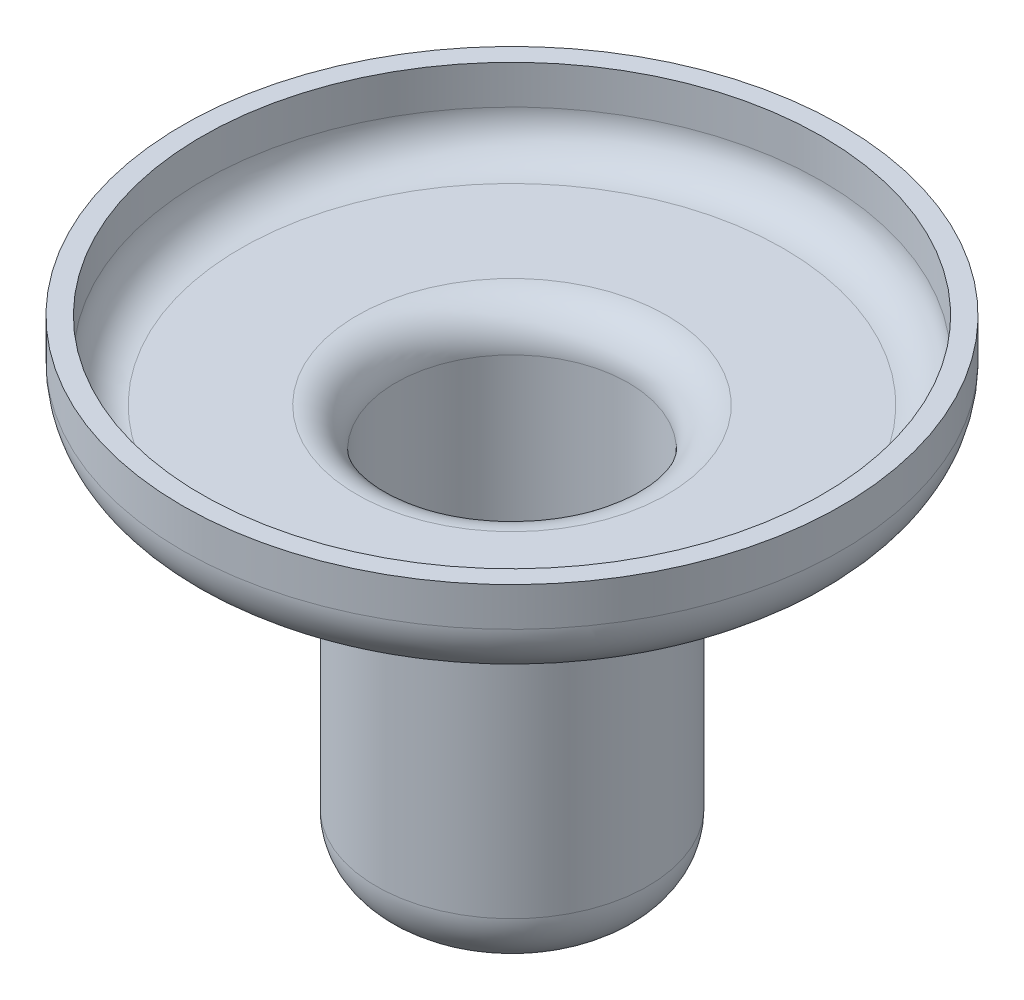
ISO-10303-21;
HEADER;
FILE_DESCRIPTION(('STEP AP214'),'2;1');
FILE_NAME('part.step','',(''),(''),'','','');
FILE_SCHEMA(('AUTOMOTIVE_DESIGN { 1 0 10303 214 1 1 1 1 }'));
ENDSEC;
DATA;
#1=APPLICATION_CONTEXT('core data for automotive mechanical design processes');
#2=APPLICATION_PROTOCOL_DEFINITION('international standard','automotive_design',2000,#1);
#3=PRODUCT_CONTEXT('',#1,'mechanical');
#4=PRODUCT('Part','Part','',(#3));
#5=PRODUCT_RELATED_PRODUCT_CATEGORY('part','',(#4));
#6=PRODUCT_DEFINITION_FORMATION('','',#4);
#7=PRODUCT_DEFINITION_CONTEXT('part definition',#1,'design');
#8=PRODUCT_DEFINITION('design','',#6,#7);
#9=PRODUCT_DEFINITION_SHAPE('','',#8);
#10=(LENGTH_UNIT() NAMED_UNIT(*) SI_UNIT(.MILLI.,.METRE.));
#11=(NAMED_UNIT(*) PLANE_ANGLE_UNIT() SI_UNIT($,.RADIAN.));
#12=(NAMED_UNIT(*) SI_UNIT($,.STERADIAN.) SOLID_ANGLE_UNIT());
#13=UNCERTAINTY_MEASURE_WITH_UNIT(LENGTH_MEASURE(1.E-05),#10,'distance_accuracy_value','');
#14=(GEOMETRIC_REPRESENTATION_CONTEXT(3) GLOBAL_UNCERTAINTY_ASSIGNED_CONTEXT((#13)) GLOBAL_UNIT_ASSIGNED_CONTEXT((#10,
#11,#12)) REPRESENTATION_CONTEXT('',''));
#15=CARTESIAN_POINT('',(0.,0.,0.));
#16=DIRECTION('',(0.,0.,1.));
#17=DIRECTION('',(1.,0.,0.));
#18=AXIS2_PLACEMENT_3D('',#15,#16,#17);
#19=CARTESIAN_POINT('',(0.,0.,0.));
#20=DIRECTION('',(0.,-1.,0.));
#21=DIRECTION('',(0.,0.,-1.));
#22=AXIS2_PLACEMENT_3D('',#19,#20,#21);
#23=CYLINDRICAL_SURFACE('',#22,17.);
#24=CARTESIAN_POINT('',(0.,4.,0.));
#25=DIRECTION('',(0.,-1.,0.));
#26=DIRECTION('',(0.,0.,-1.));
#27=AXIS2_PLACEMENT_3D('',#24,#25,#26);
#28=CIRCLE('',#27,17.);
#29=CARTESIAN_POINT('',(0.,4.,-17.));
#30=VERTEX_POINT('',#29);
#31=EDGE_CURVE('E10',#30,#30,#28,.T.);
#32=ORIENTED_EDGE('',*,*,#31,.T.);
#33=EDGE_LOOP('',(#32));
#34=FACE_BOUND('',#33,.T.);
#35=CARTESIAN_POINT('',(0.,2.,0.));
#36=DIRECTION('',(0.,-1.,0.));
#37=DIRECTION('',(0.,0.,-1.));
#38=AXIS2_PLACEMENT_3D('',#35,#36,#37);
#39=CIRCLE('',#38,17.);
#40=CARTESIAN_POINT('',(0.,2.,-17.));
#41=VERTEX_POINT('',#40);
#42=EDGE_CURVE('E73',#41,#41,#39,.T.);
#43=ORIENTED_EDGE('',*,*,#42,.F.);
#44=EDGE_LOOP('',(#43));
#45=FACE_BOUND('',#44,.T.);
#46=ADVANCED_FACE('F27',(#34,#45),#23,.T.);
#47=CARTESIAN_POINT('',(16.,4.,0.));
#48=DIRECTION('',(0.,-1.,0.));
#49=DIRECTION('',(0.,0.,-1.));
#50=AXIS2_PLACEMENT_3D('',#47,#48,#49);
#51=PLANE('',#50);
#52=ORIENTED_EDGE('',*,*,#31,.F.);
#53=EDGE_LOOP('',(#52));
#54=FACE_BOUND('',#53,.T.);
#55=CARTESIAN_POINT('',(0.,4.,0.));
#56=DIRECTION('',(0.,-1.,0.));
#57=DIRECTION('',(0.,0.,-1.));
#58=AXIS2_PLACEMENT_3D('',#55,#56,#57);
#59=CIRCLE('',#58,16.);
#60=CARTESIAN_POINT('',(0.,4.,-16.));
#61=VERTEX_POINT('',#60);
#62=EDGE_CURVE('E33',#61,#61,#59,.T.);
#63=ORIENTED_EDGE('',*,*,#62,.T.);
#64=EDGE_LOOP('',(#63));
#65=FACE_BOUND('',#64,.T.);
#66=ADVANCED_FACE('F81',(#54,#65),#51,.F.);
#67=CARTESIAN_POINT('',(0.,0.,0.));
#68=DIRECTION('',(0.,-1.,0.));
#69=DIRECTION('',(0.,0.,-1.));
#70=AXIS2_PLACEMENT_3D('',#67,#68,#69);
#71=CYLINDRICAL_SURFACE('',#70,16.);
#72=ORIENTED_EDGE('',*,*,#62,.F.);
#73=EDGE_LOOP('',(#72));
#74=FACE_BOUND('',#73,.T.);
#75=CARTESIAN_POINT('',(0.,2.,0.));
#76=DIRECTION('',(0.,-1.,0.));
#77=DIRECTION('',(0.,0.,-1.));
#78=AXIS2_PLACEMENT_3D('',#75,#76,#77);
#79=CIRCLE('',#78,16.);
#80=CARTESIAN_POINT('',(0.,2.,-16.));
#81=VERTEX_POINT('',#80);
#82=EDGE_CURVE('E37',#81,#81,#79,.T.);
#83=ORIENTED_EDGE('',*,*,#82,.T.);
#84=EDGE_LOOP('',(#83));
#85=FACE_BOUND('',#84,.T.);
#86=ADVANCED_FACE('F85',(#74,#85),#71,.F.);
#87=CARTESIAN_POINT('',(0.,2.,0.));
#88=DIRECTION('',(0.,-1.,0.));
#89=DIRECTION('',(0.,0.,-1.));
#90=AXIS2_PLACEMENT_3D('',#87,#88,#89);
#91=TOROIDAL_SURFACE('',#90,14.,2.);
#92=ORIENTED_EDGE('',*,*,#82,.F.);
#93=EDGE_LOOP('',(#92));
#94=FACE_BOUND('',#93,.T.);
#95=CARTESIAN_POINT('',(0.,0.,0.));
#96=DIRECTION('',(0.,-1.,0.));
#97=DIRECTION('',(0.,0.,-1.));
#98=AXIS2_PLACEMENT_3D('',#95,#96,#97);
#99=CIRCLE('',#98,14.);
#100=CARTESIAN_POINT('',(0.,0.,-14.));
#101=VERTEX_POINT('',#100);
#102=EDGE_CURVE('E41',#101,#101,#99,.T.);
#103=ORIENTED_EDGE('',*,*,#102,.T.);
#104=EDGE_LOOP('',(#103));
#105=FACE_BOUND('',#104,.T.);
#106=ADVANCED_FACE('F90',(#94,#105),#91,.F.);
#107=CARTESIAN_POINT('',(8.00000000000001,0.,0.));
#108=DIRECTION('',(0.,-1.,0.));
#109=DIRECTION('',(0.,0.,-1.));
#110=AXIS2_PLACEMENT_3D('',#107,#108,#109);
#111=PLANE('',#110);
#112=ORIENTED_EDGE('',*,*,#102,.F.);
#113=EDGE_LOOP('',(#112));
#114=FACE_BOUND('',#113,.T.);
#115=CARTESIAN_POINT('',(0.,0.,0.));
#116=DIRECTION('',(0.,-1.,0.));
#117=DIRECTION('',(0.,0.,-1.));
#118=AXIS2_PLACEMENT_3D('',#115,#116,#117);
#119=CIRCLE('',#118,8.00000000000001);
#120=CARTESIAN_POINT('',(0.,0.,-8.00000000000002));
#121=VERTEX_POINT('',#120);
#122=EDGE_CURVE('E46',#121,#121,#119,.T.);
#123=ORIENTED_EDGE('',*,*,#122,.T.);
#124=EDGE_LOOP('',(#123));
#125=FACE_BOUND('',#124,.T.);
#126=ADVANCED_FACE('F96',(#114,#125),#111,.F.);
#127=CARTESIAN_POINT('',(0.,-2.,0.));
#128=DIRECTION('',(0.,-1.,0.));
#129=DIRECTION('',(0.,0.,-1.));
#130=AXIS2_PLACEMENT_3D('',#127,#128,#129);
#131=TOROIDAL_SURFACE('',#130,8.,2.);
#132=ORIENTED_EDGE('',*,*,#122,.F.);
#133=EDGE_LOOP('',(#132));
#134=FACE_BOUND('',#133,.T.);
#135=CARTESIAN_POINT('',(0.,-2.,0.));
#136=DIRECTION('',(0.,-1.,0.));
#137=DIRECTION('',(0.,0.,-1.));
#138=AXIS2_PLACEMENT_3D('',#135,#136,#137);
#139=CIRCLE('',#138,6.);
#140=CARTESIAN_POINT('',(0.,-2.,-6.00000000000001));
#141=VERTEX_POINT('',#140);
#142=EDGE_CURVE('E49',#141,#141,#139,.T.);
#143=ORIENTED_EDGE('',*,*,#142,.T.);
#144=EDGE_LOOP('',(#143));
#145=FACE_BOUND('',#144,.T.);
#146=ADVANCED_FACE('F100',(#134,#145),#131,.T.);
#147=CARTESIAN_POINT('',(0.,0.,0.));
#148=DIRECTION('',(0.,-1.,0.));
#149=DIRECTION('',(0.,0.,-1.));
#150=AXIS2_PLACEMENT_3D('',#147,#148,#149);
#151=CYLINDRICAL_SURFACE('',#150,6.);
#152=ORIENTED_EDGE('',*,*,#142,.F.);
#153=EDGE_LOOP('',(#152));
#154=FACE_BOUND('',#153,.T.);
#155=CARTESIAN_POINT('',(0.,-18.,0.));
#156=DIRECTION('',(0.,-1.,0.));
#157=DIRECTION('',(0.,0.,-1.));
#158=AXIS2_PLACEMENT_3D('',#155,#156,#157);
#159=CIRCLE('',#158,6.);
#160=CARTESIAN_POINT('',(0.,-18.,-6.00000000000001));
#161=VERTEX_POINT('',#160);
#162=EDGE_CURVE('E52',#161,#161,#159,.T.);
#163=ORIENTED_EDGE('',*,*,#162,.T.);
#164=EDGE_LOOP('',(#163));
#165=FACE_BOUND('',#164,.T.);
#166=ADVANCED_FACE('F104',(#154,#165),#151,.F.);
#167=CARTESIAN_POINT('',(0.,-18.,0.));
#168=DIRECTION('',(0.,-1.,0.));
#169=DIRECTION('',(0.,0.,-1.));
#170=AXIS2_PLACEMENT_3D('',#167,#168,#169);
#171=TOROIDAL_SURFACE('',#170,4.,2.);
#172=ORIENTED_EDGE('',*,*,#162,.F.);
#173=EDGE_LOOP('',(#172));
#174=FACE_BOUND('',#173,.T.);
#175=CARTESIAN_POINT('',(0.,-20.,0.));
#176=DIRECTION('',(0.,-1.,0.));
#177=DIRECTION('',(0.,0.,-1.));
#178=AXIS2_PLACEMENT_3D('',#175,#176,#177);
#179=CIRCLE('',#178,3.99999999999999);
#180=CARTESIAN_POINT('',(0.,-20.,-3.99999999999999));
#181=VERTEX_POINT('',#180);
#182=EDGE_CURVE('E55',#181,#181,#179,.T.);
#183=ORIENTED_EDGE('',*,*,#182,.T.);
#184=EDGE_LOOP('',(#183));
#185=FACE_BOUND('',#184,.T.);
#186=ADVANCED_FACE('F108',(#174,#185),#171,.F.);
#187=CARTESIAN_POINT('',(3.99999999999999,-20.,0.));
#188=DIRECTION('',(0.,-1.,0.));
#189=DIRECTION('',(0.,0.,-1.));
#190=AXIS2_PLACEMENT_3D('',#187,#188,#189);
#191=PLANE('',#190);
#192=ORIENTED_EDGE('',*,*,#182,.F.);
#193=EDGE_LOOP('',(#192));
#194=FACE_BOUND('',#193,.T.);
#195=ADVANCED_FACE('F112',(#194),#191,.F.);
#196=CARTESIAN_POINT('',(3.99999999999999,-21.,0.));
#197=DIRECTION('',(0.,-1.,0.));
#198=DIRECTION('',(0.,0.,-1.));
#199=AXIS2_PLACEMENT_3D('',#196,#197,#198);
#200=PLANE('',#199);
#201=CARTESIAN_POINT('',(0.,-21.,0.));
#202=DIRECTION('',(0.,-1.,0.));
#203=DIRECTION('',(0.,0.,-1.));
#204=AXIS2_PLACEMENT_3D('',#201,#202,#203);
#205=CIRCLE('',#204,3.99999999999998);
#206=CARTESIAN_POINT('',(0.,-21.,-3.99999999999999));
#207=VERTEX_POINT('',#206);
#208=EDGE_CURVE('E58',#207,#207,#205,.T.);
#209=ORIENTED_EDGE('',*,*,#208,.T.);
#210=EDGE_LOOP('',(#209));
#211=FACE_BOUND('',#210,.T.);
#212=ADVANCED_FACE('F116',(#211),#200,.T.);
#213=CARTESIAN_POINT('',(0.,-18.,0.));
#214=DIRECTION('',(0.,-1.,0.));
#215=DIRECTION('',(0.,0.,-1.));
#216=AXIS2_PLACEMENT_3D('',#213,#214,#215);
#217=TOROIDAL_SURFACE('',#216,4.,3.);
#218=CARTESIAN_POINT('',(0.,-18.,0.));
#219=DIRECTION('',(0.,-1.,0.));
#220=DIRECTION('',(0.,0.,-1.));
#221=AXIS2_PLACEMENT_3D('',#218,#219,#220);
#222=CIRCLE('',#221,7.);
#223=CARTESIAN_POINT('',(0.,-18.,-7.00000000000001));
#224=VERTEX_POINT('',#223);
#225=EDGE_CURVE('E61',#224,#224,#222,.T.);
#226=ORIENTED_EDGE('',*,*,#225,.T.);
#227=EDGE_LOOP('',(#226));
#228=FACE_BOUND('',#227,.T.);
#229=ORIENTED_EDGE('',*,*,#208,.F.);
#230=EDGE_LOOP('',(#229));
#231=FACE_BOUND('',#230,.T.);
#232=ADVANCED_FACE('F120',(#228,#231),#217,.T.);
#233=CARTESIAN_POINT('',(0.,0.,0.));
#234=DIRECTION('',(0.,-1.,0.));
#235=DIRECTION('',(0.,0.,-1.));
#236=AXIS2_PLACEMENT_3D('',#233,#234,#235);
#237=CYLINDRICAL_SURFACE('',#236,7.);
#238=CARTESIAN_POINT('',(0.,-2.,0.));
#239=DIRECTION('',(0.,-1.,0.));
#240=DIRECTION('',(0.,0.,-1.));
#241=AXIS2_PLACEMENT_3D('',#238,#239,#240);
#242=CIRCLE('',#241,7.);
#243=CARTESIAN_POINT('',(0.,-2.,-7.00000000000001));
#244=VERTEX_POINT('',#243);
#245=EDGE_CURVE('E64',#244,#244,#242,.T.);
#246=ORIENTED_EDGE('',*,*,#245,.T.);
#247=EDGE_LOOP('',(#246));
#248=FACE_BOUND('',#247,.T.);
#249=ORIENTED_EDGE('',*,*,#225,.F.);
#250=EDGE_LOOP('',(#249));
#251=FACE_BOUND('',#250,.T.);
#252=ADVANCED_FACE('F124',(#248,#251),#237,.T.);
#253=CARTESIAN_POINT('',(0.,-2.,0.));
#254=DIRECTION('',(0.,-1.,0.));
#255=DIRECTION('',(0.,0.,-1.));
#256=AXIS2_PLACEMENT_3D('',#253,#254,#255);
#257=TOROIDAL_SURFACE('',#256,8.,1.);
#258=CARTESIAN_POINT('',(0.,-1.,0.));
#259=DIRECTION('',(0.,-1.,0.));
#260=DIRECTION('',(0.,0.,-1.));
#261=AXIS2_PLACEMENT_3D('',#258,#259,#260);
#262=CIRCLE('',#261,8.00000000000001);
#263=CARTESIAN_POINT('',(0.,-1.,-8.00000000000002));
#264=VERTEX_POINT('',#263);
#265=EDGE_CURVE('E67',#264,#264,#262,.T.);
#266=ORIENTED_EDGE('',*,*,#265,.T.);
#267=EDGE_LOOP('',(#266));
#268=FACE_BOUND('',#267,.T.);
#269=ORIENTED_EDGE('',*,*,#245,.F.);
#270=EDGE_LOOP('',(#269));
#271=FACE_BOUND('',#270,.T.);
#272=ADVANCED_FACE('F128',(#268,#271),#257,.F.);
#273=CARTESIAN_POINT('',(8.00000000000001,-1.,0.));
#274=DIRECTION('',(0.,-1.,0.));
#275=DIRECTION('',(0.,0.,-1.));
#276=AXIS2_PLACEMENT_3D('',#273,#274,#275);
#277=PLANE('',#276);
#278=CARTESIAN_POINT('',(0.,-1.,0.));
#279=DIRECTION('',(0.,-1.,0.));
#280=DIRECTION('',(0.,0.,-1.));
#281=AXIS2_PLACEMENT_3D('',#278,#279,#280);
#282=CIRCLE('',#281,14.);
#283=CARTESIAN_POINT('',(0.,-1.,-14.));
#284=VERTEX_POINT('',#283);
#285=EDGE_CURVE('E70',#284,#284,#282,.T.);
#286=ORIENTED_EDGE('',*,*,#285,.T.);
#287=EDGE_LOOP('',(#286));
#288=FACE_BOUND('',#287,.T.);
#289=ORIENTED_EDGE('',*,*,#265,.F.);
#290=EDGE_LOOP('',(#289));
#291=FACE_BOUND('',#290,.T.);
#292=ADVANCED_FACE('F132',(#288,#291),#277,.T.);
#293=CARTESIAN_POINT('',(0.,2.,0.));
#294=DIRECTION('',(0.,-1.,0.));
#295=DIRECTION('',(0.,0.,-1.));
#296=AXIS2_PLACEMENT_3D('',#293,#294,#295);
#297=TOROIDAL_SURFACE('',#296,14.,3.);
#298=ORIENTED_EDGE('',*,*,#42,.T.);
#299=EDGE_LOOP('',(#298));
#300=FACE_BOUND('',#299,.T.);
#301=ORIENTED_EDGE('',*,*,#285,.F.);
#302=EDGE_LOOP('',(#301));
#303=FACE_BOUND('',#302,.T.);
#304=ADVANCED_FACE('F77',(#300,#303),#297,.T.);
#305=CLOSED_SHELL('',(#46,#66,#86,#106,#126,#146,#166,#186,#195,#212,#232,#252,#272,#292,#304));
#306=MANIFOLD_SOLID_BREP('B2',#305);
#307=ADVANCED_BREP_SHAPE_REPRESENTATION('',(#18,#306),#14);
#308=SHAPE_DEFINITION_REPRESENTATION(#9,#307);
ENDSEC;
END-ISO-10303-21;
